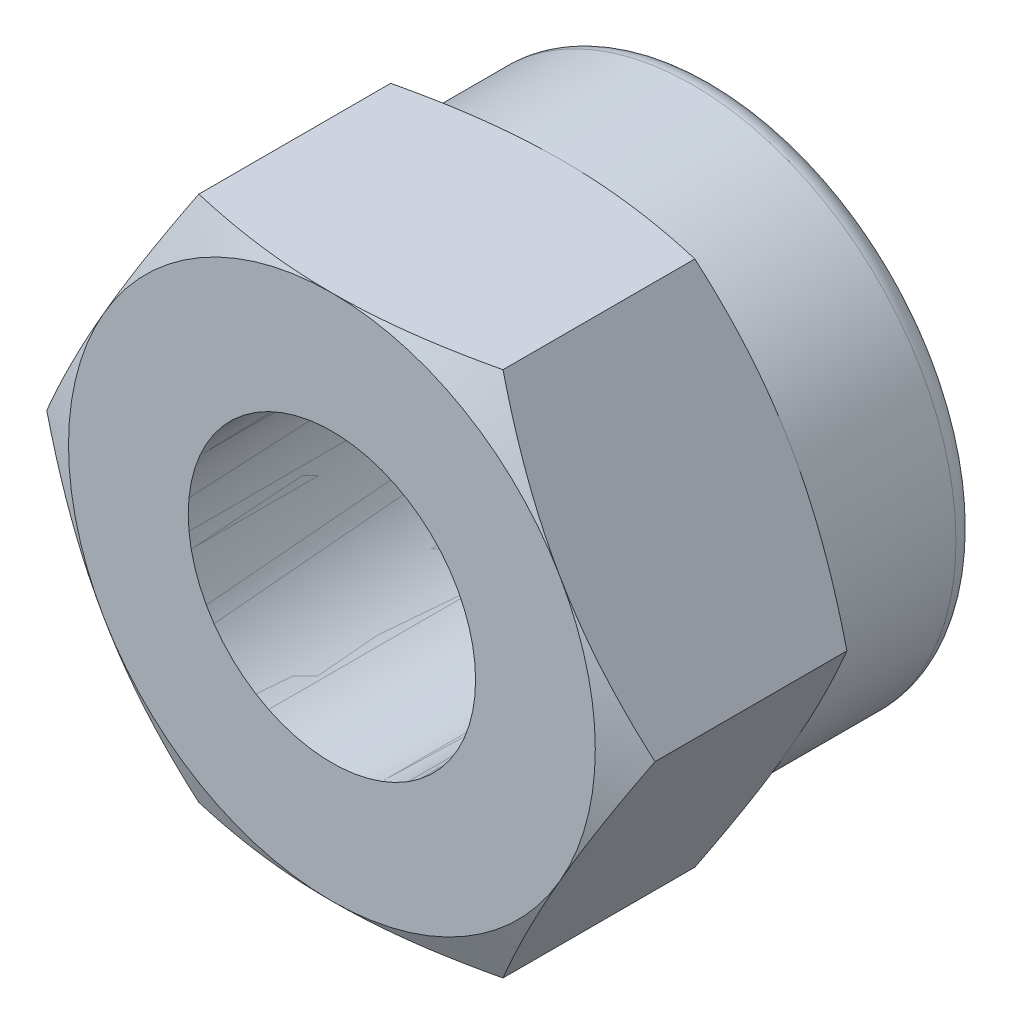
ISO-10303-21;
HEADER;
FILE_DESCRIPTION(('STEP AP214'),'2;1');
FILE_NAME('part.step','',(''),(''),'','','');
FILE_SCHEMA(('AUTOMOTIVE_DESIGN { 1 0 10303 214 1 1 1 1 }'));
ENDSEC;
DATA;
#1=APPLICATION_CONTEXT('core data for automotive mechanical design processes');
#2=APPLICATION_PROTOCOL_DEFINITION('international standard','automotive_design',2000,#1);
#3=PRODUCT_CONTEXT('',#1,'mechanical');
#4=PRODUCT('Part','Part','',(#3));
#5=PRODUCT_RELATED_PRODUCT_CATEGORY('part','',(#4));
#6=PRODUCT_DEFINITION_FORMATION('','',#4);
#7=PRODUCT_DEFINITION_CONTEXT('part definition',#1,'design');
#8=PRODUCT_DEFINITION('design','',#6,#7);
#9=PRODUCT_DEFINITION_SHAPE('','',#8);
#10=(LENGTH_UNIT() NAMED_UNIT(*) SI_UNIT(.MILLI.,.METRE.));
#11=(NAMED_UNIT(*) PLANE_ANGLE_UNIT() SI_UNIT($,.RADIAN.));
#12=(NAMED_UNIT(*) SI_UNIT($,.STERADIAN.) SOLID_ANGLE_UNIT());
#13=UNCERTAINTY_MEASURE_WITH_UNIT(LENGTH_MEASURE(1.E-05),#10,'distance_accuracy_value','');
#14=(GEOMETRIC_REPRESENTATION_CONTEXT(3) GLOBAL_UNCERTAINTY_ASSIGNED_CONTEXT((#13)) GLOBAL_UNIT_ASSIGNED_CONTEXT((#10,
#11,#12)) REPRESENTATION_CONTEXT('',''));
#15=CARTESIAN_POINT('',(0.,0.,0.));
#16=DIRECTION('',(0.,0.,1.));
#17=DIRECTION('',(1.,0.,0.));
#18=AXIS2_PLACEMENT_3D('',#15,#16,#17);
#19=CARTESIAN_POINT('',(0.,0.,2.4));
#20=DIRECTION('',(0.,0.,-1.));
#21=DIRECTION('',(-1.,0.,0.));
#22=AXIS2_PLACEMENT_3D('',#19,#20,#21);
#23=CYLINDRICAL_SURFACE('',#22,1.5);
#24=CARTESIAN_POINT('',(0.,0.,0.));
#25=DIRECTION('',(0.,0.,-1.));
#26=DIRECTION('',(-1.,0.,0.));
#27=AXIS2_PLACEMENT_3D('',#24,#25,#26);
#28=CIRCLE('',#27,1.5);
#29=CARTESIAN_POINT('',(-1.5,0.,0.));
#30=VERTEX_POINT('',#29);
#31=EDGE_CURVE('P0_E16',#30,#30,#28,.F.);
#32=ORIENTED_EDGE('',*,*,#31,.T.);
#33=EDGE_LOOP('',(#32));
#34=FACE_BOUND('',#33,.T.);
#35=CARTESIAN_POINT('',(0.,0.,2.4));
#36=DIRECTION('',(0.,0.,-1.));
#37=DIRECTION('',(-1.,0.,0.));
#38=AXIS2_PLACEMENT_3D('',#35,#36,#37);
#39=CIRCLE('',#38,1.5);
#40=CARTESIAN_POINT('',(-1.5,0.,2.4));
#41=VERTEX_POINT('',#40);
#42=EDGE_CURVE('P0_E10',#41,#41,#39,.T.);
#43=ORIENTED_EDGE('',*,*,#42,.T.);
#44=EDGE_LOOP('',(#43));
#45=FACE_BOUND('',#44,.T.);
#46=ADVANCED_FACE('P0_F15',(#34,#45),#23,.T.);
#47=OPEN_SHELL('',(#46));
#48=SHELL_BASED_SURFACE_MODEL('P0_B1',(#47));
#49=CARTESIAN_POINT('',(0.,0.,0.199569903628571));
#50=DIRECTION('',(0.,0.,1.));
#51=DIRECTION('',(0.,-1.,0.));
#52=AXIS2_PLACEMENT_3D('',#49,#50,#51);
#53=CONICAL_SURFACE('',#52,3.17797903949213,1.13446401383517);
#54=CARTESIAN_POINT('',(1.58771327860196,-2.75,0.198379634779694));
#55=CARTESIAN_POINT('',(1.45743313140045,-2.75,0.167999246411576));
#56=CARTESIAN_POINT('',(1.32647304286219,-2.75,0.140270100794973));
#57=CARTESIAN_POINT('',(1.06378563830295,-2.75,0.0914586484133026));
#58=CARTESIAN_POINT('',(0.932062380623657,-2.75,0.0703543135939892));
#59=CARTESIAN_POINT('',(0.667468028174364,-2.75,0.0359033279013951));
#60=CARTESIAN_POINT('',(0.534596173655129,-2.75,0.0225622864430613));
#61=CARTESIAN_POINT('',(0.334638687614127,-2.75,0.00909051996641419));
#62=CARTESIAN_POINT('',(0.267762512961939,-2.75,0.00568971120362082));
#63=CARTESIAN_POINT('',(0.133926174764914,-2.75,0.00114123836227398));
#64=CARTESIAN_POINT('',(0.0669660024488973,-2.75,-6.16666171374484E-06));
#65=CARTESIAN_POINT('',(0.,-2.75,3.81688682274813E-12));
#66=B_SPLINE_CURVE_WITH_KNOTS('',3,(#54,#55,#56,#57,#58,#59,#60,#61,#62,#63,#64,#65),
.UNSPECIFIED.,.F.,.F.,(4,2,2,2,2,4),(0.,0.401386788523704,0.801424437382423,1.20175077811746,
1.40260491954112,1.6034821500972),.UNSPECIFIED.);
#67=CARTESIAN_POINT('',(1.58771325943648,-2.75,0.198379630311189));
#68=VERTEX_POINT('',#67);
#69=CARTESIAN_POINT('',(0.,-2.75,1.90844438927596E-12));
#70=VERTEX_POINT('',#69);
#71=EDGE_CURVE('P1_E138',#68,#70,#66,.T.);
#72=ORIENTED_EDGE('',*,*,#71,.T.);
#73=CARTESIAN_POINT('',(0.,0.,0.));
#74=DIRECTION('',(0.,0.,1.));
#75=DIRECTION('',(1.,0.,0.));
#76=AXIS2_PLACEMENT_3D('',#73,#74,#75);
#77=CIRCLE('',#76,2.75);
#78=CARTESIAN_POINT('',(2.38156985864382,-1.3750000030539,1.82053797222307E-12));
#79=VERTEX_POINT('',#78);
#80=EDGE_CURVE('P1_E116',#79,#70,#77,.F.);
#81=ORIENTED_EDGE('',*,*,#80,.F.);
#82=CARTESIAN_POINT('',(2.38156985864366,-1.3750000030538,3.64105743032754E-12));
#83=CARTESIAN_POINT('',(2.34808686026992,-1.43299425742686,-6.16661975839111E-06));
#84=CARTESIAN_POINT('',(2.3146067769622,-1.49098346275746,0.0011412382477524));
#85=CARTESIAN_POINT('',(2.2476886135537,-1.60688912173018,0.00568971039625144));
#86=CARTESIAN_POINT('',(2.21425052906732,-1.66480558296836,0.00909051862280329));
#87=CARTESIAN_POINT('',(2.1142717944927,-1.83797383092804,0.022562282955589));
#88=CARTESIAN_POINT('',(2.04783587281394,-1.95304422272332,0.0359033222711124));
#89=CARTESIAN_POINT('',(1.91553870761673,-2.18218963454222,0.0703543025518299));
#90=CARTESIAN_POINT('',(1.84967708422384,-2.29626531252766,0.0914586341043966));
#91=CARTESIAN_POINT('',(1.71833339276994,-2.52375925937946,0.140270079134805));
#92=CARTESIAN_POINT('',(1.65285335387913,-2.63717401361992,0.167999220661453));
#93=CARTESIAN_POINT('',(1.58771328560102,-2.74999992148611,0.19837960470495));
#94=B_SPLINE_CURVE_WITH_KNOTS('',3,(#82,#83,#84,#85,#86,#87,#88,#89,#90,#91,#92,#93),
.UNSPECIFIED.,.F.,.F.,(4,2,2,2,2,4),(0.,0.200877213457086,0.40173133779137,0.802057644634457,
1.20209525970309,1.60348201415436),.UNSPECIFIED.);
#95=EDGE_CURVE('P1_E130',#79,#68,#94,.T.);
#96=ORIENTED_EDGE('',*,*,#95,.T.);
#97=EDGE_LOOP('',(#72,#81,#96));
#98=FACE_BOUND('',#97,.T.);
#99=ADVANCED_FACE('P1_F17',(#98),#53,.T.);
#100=CARTESIAN_POINT('',(0.,0.,0.199569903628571));
#101=DIRECTION('',(0.,0.,1.));
#102=DIRECTION('',(0.,-1.,0.));
#103=AXIS2_PLACEMENT_3D('',#100,#101,#102);
#104=CONICAL_SURFACE('',#103,3.17797903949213,1.13446401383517);
#105=CARTESIAN_POINT('',(-1.58771322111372,-2.75000003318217,0.19837963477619));
#106=CARTESIAN_POINT('',(-1.65285329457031,-2.6371741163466,0.167999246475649));
#107=CARTESIAN_POINT('',(-1.71833333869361,-2.52375935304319,0.140270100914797));
#108=CARTESIAN_POINT('',(-1.84967704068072,-2.29626538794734,0.0914586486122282));
#109=CARTESIAN_POINT('',(-1.91553866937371,-2.18218970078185,0.0703543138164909));
#110=CARTESIAN_POINT('',(-2.04783584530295,-1.95304427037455,0.0359033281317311));
#111=CARTESIAN_POINT('',(-2.11427177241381,-1.83797386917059,0.0225622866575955));
#112=CARTESIAN_POINT('',(-2.21425051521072,-1.6648056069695,0.00909052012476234));
#113=CARTESIAN_POINT('',(-2.24768860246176,-1.60688914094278,0.00568971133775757));
#114=CARTESIAN_POINT('',(-2.31460677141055,-1.490983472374,0.00114123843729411));
#115=CARTESIAN_POINT('',(-2.34808685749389,-1.43299426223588,-6.16662160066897E-06));
#116=CARTESIAN_POINT('',(-2.381569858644,-1.375000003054,3.8260401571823E-12));
#117=B_SPLINE_CURVE_WITH_KNOTS('',3,(#105,#106,#107,#108,#109,#110,#111,#112,#113,#114,#115,
#116),.UNSPECIFIED.,.F.,.F.,(4,2,2,2,2,4),(0.,0.40138678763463,0.801424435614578,
1.20175077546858,1.40260491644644,1.6034821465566),.UNSPECIFIED.);
#118=CARTESIAN_POINT('',(-1.58771323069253,-2.75000001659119,0.198379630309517));
#119=VERTEX_POINT('',#118);
#120=CARTESIAN_POINT('',(-2.3815698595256,-1.37500000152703,1.91301516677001E-12));
#121=VERTEX_POINT('',#120);
#122=EDGE_CURVE('P1_E150',#119,#121,#117,.T.);
#123=ORIENTED_EDGE('',*,*,#122,.T.);
#124=CARTESIAN_POINT('',(0.,0.,0.));
#125=DIRECTION('',(0.,0.,1.));
#126=DIRECTION('',(1.,0.,0.));
#127=AXIS2_PLACEMENT_3D('',#124,#125,#126);
#128=CIRCLE('',#127,2.75);
#129=EDGE_CURVE('P1_E149',#70,#121,#128,.F.);
#130=ORIENTED_EDGE('',*,*,#129,.F.);
#131=CARTESIAN_POINT('',(0.,-2.75,3.81691868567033E-12));
#132=CARTESIAN_POINT('',(-0.0669659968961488,-2.75,-6.16665968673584E-06));
#133=CARTESIAN_POINT('',(-0.133926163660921,-2.75,0.00114123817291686));
#134=CARTESIAN_POINT('',(-0.267762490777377,-2.75,0.005689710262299));
#135=CARTESIAN_POINT('',(-0.334638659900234,-2.75,0.00909051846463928));
#136=CARTESIAN_POINT('',(-0.53459612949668,-2.75,0.022562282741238));
#137=CARTESIAN_POINT('',(-0.667467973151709,-2.75,0.0359033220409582));
#138=CARTESIAN_POINT('',(-0.932062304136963,-2.75,0.0703543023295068));
#139=CARTESIAN_POINT('',(-1.06378555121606,-2.75,0.0914586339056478));
#140=CARTESIAN_POINT('',(-1.32647293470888,-2.75,0.140270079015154));
#141=CARTESIAN_POINT('',(-1.45743301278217,-2.75,0.167999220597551));
#142=CARTESIAN_POINT('',(-1.58771314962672,-2.75,0.198379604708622));
#143=B_SPLINE_CURVE_WITH_KNOTS('',3,(#131,#132,#133,#134,#135,#136,#137,#138,#139,#140,#141,
#142),.UNSPECIFIED.,.F.,.F.,(4,2,2,2,2,4),(0.,0.200877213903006,0.401731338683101,
0.802057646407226,1.20209526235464,1.60348201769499),.UNSPECIFIED.);
#144=EDGE_CURVE('P1_E155',#70,#119,#143,.T.);
#145=ORIENTED_EDGE('',*,*,#144,.T.);
#146=EDGE_LOOP('',(#123,#130,#145));
#147=FACE_BOUND('',#146,.T.);
#148=ADVANCED_FACE('P1_F229',(#147),#104,.T.);
#149=CARTESIAN_POINT('',(0.,0.,-1.365296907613));
#150=DIRECTION('',(0.,0.,1.));
#151=DIRECTION('',(-1.,0.,0.));
#152=AXIS2_PLACEMENT_3D('',#149,#150,#151);
#153=TOROIDAL_SURFACE('',#152,2.515296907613,0.2347030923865);
#154=CARTESIAN_POINT('',(0.,0.,-1.365296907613));
#155=DIRECTION('',(0.,0.,1.));
#156=DIRECTION('',(1.,0.,0.));
#157=AXIS2_PLACEMENT_3D('',#154,#155,#156);
#158=CIRCLE('',#157,2.75);
#159=CARTESIAN_POINT('',(2.75,0.,-1.365296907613));
#160=VERTEX_POINT('',#159);
#161=EDGE_CURVE('P1_E257',#160,#160,#158,.T.);
#162=ORIENTED_EDGE('',*,*,#161,.F.);
#163=EDGE_LOOP('',(#162));
#164=FACE_BOUND('',#163,.T.);
#165=CARTESIAN_POINT('',(0.,0.,-1.5999999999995));
#166=DIRECTION('',(0.,0.,1.));
#167=DIRECTION('',(1.,0.,0.));
#168=AXIS2_PLACEMENT_3D('',#165,#166,#167);
#169=CIRCLE('',#168,2.515296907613);
#170=CARTESIAN_POINT('',(2.515296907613,0.,-1.5999999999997));
#171=VERTEX_POINT('',#170);
#172=CARTESIAN_POINT('',(-2.515296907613,0.,-1.5999999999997));
#173=VERTEX_POINT('',#172);
#174=EDGE_CURVE('P1_E253',#171,#173,#169,.T.);
#175=ORIENTED_EDGE('',*,*,#174,.T.);
#176=CARTESIAN_POINT('',(0.,0.,-1.5999999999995));
#177=DIRECTION('',(0.,0.,1.));
#178=DIRECTION('',(-1.,0.,0.));
#179=AXIS2_PLACEMENT_3D('',#176,#177,#178);
#180=CIRCLE('',#179,2.515296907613);
#181=EDGE_CURVE('P1_E268',#173,#171,#180,.T.);
#182=ORIENTED_EDGE('',*,*,#181,.T.);
#183=EDGE_LOOP('',(#175,#182));
#184=FACE_BOUND('',#183,.T.);
#185=ADVANCED_FACE('P1_F232',(#164,#184),#153,.T.);
#186=CARTESIAN_POINT('',(0.,0.,0.199569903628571));
#187=DIRECTION('',(0.,0.,1.));
#188=DIRECTION('',(0.,-1.,0.));
#189=AXIS2_PLACEMENT_3D('',#186,#187,#188);
#190=CONICAL_SURFACE('',#189,3.17797903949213,1.13446401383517);
#191=CARTESIAN_POINT('',(-1.58771327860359,2.75,0.198379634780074));
#192=CARTESIAN_POINT('',(-1.45743313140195,2.75,0.167999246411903));
#193=CARTESIAN_POINT('',(-1.32647304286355,2.75,0.140270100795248));
#194=CARTESIAN_POINT('',(-1.06378563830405,2.75,0.0914586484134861));
#195=CARTESIAN_POINT('',(-0.932062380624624,2.75,0.0703543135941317));
#196=CARTESIAN_POINT('',(-0.66746802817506,2.75,0.0359033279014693));
#197=CARTESIAN_POINT('',(-0.534596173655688,2.75,0.0225622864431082));
#198=CARTESIAN_POINT('',(-0.334638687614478,2.75,0.00909051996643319));
#199=CARTESIAN_POINT('',(-0.26776251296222,2.75,0.0056897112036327));
#200=CARTESIAN_POINT('',(-0.133926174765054,2.75,0.0011412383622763));
#201=CARTESIAN_POINT('',(-0.0669660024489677,2.75,-6.16666171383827E-06));
#202=CARTESIAN_POINT('',(0.,2.75,3.81688584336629E-12));
#203=B_SPLINE_CURVE_WITH_KNOTS('',3,(#191,#192,#193,#194,#195,#196,#197,#198,#199,#200,#201,
#202),.UNSPECIFIED.,.F.,.F.,(4,2,2,2,2,4),(0.,0.401386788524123,0.801424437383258,
1.20175077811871,1.40260491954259,1.60348215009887),.UNSPECIFIED.);
#204=CARTESIAN_POINT('',(-1.58771325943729,2.75,0.198379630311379));
#205=VERTEX_POINT('',#204);
#206=CARTESIAN_POINT('',(0.,2.75,1.90844292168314E-12));
#207=VERTEX_POINT('',#206);
#208=EDGE_CURVE('P1_E269',#205,#207,#203,.T.);
#209=ORIENTED_EDGE('',*,*,#208,.T.);
#210=CARTESIAN_POINT('',(0.,0.,0.));
#211=DIRECTION('',(0.,0.,1.));
#212=DIRECTION('',(1.,0.,0.));
#213=AXIS2_PLACEMENT_3D('',#210,#211,#212);
#214=CIRCLE('',#213,2.75);
#215=CARTESIAN_POINT('',(-2.38156985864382,1.3750000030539,1.82054506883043E-12));
#216=VERTEX_POINT('',#215);
#217=EDGE_CURVE('P1_E124',#216,#207,#214,.F.);
#218=ORIENTED_EDGE('',*,*,#217,.F.);
#219=CARTESIAN_POINT('',(-2.38156985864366,1.3750000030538,3.64099115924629E-12));
#220=CARTESIAN_POINT('',(-2.34808686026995,1.4329942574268,-6.16661975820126E-06));
#221=CARTESIAN_POINT('',(-2.31460677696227,1.49098346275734,0.00114123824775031));
#222=CARTESIAN_POINT('',(-2.24768861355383,1.60688912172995,0.00568971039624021));
#223=CARTESIAN_POINT('',(-2.21425052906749,1.66480558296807,0.0090905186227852));
#224=CARTESIAN_POINT('',(-2.11427179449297,1.83797383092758,0.0225622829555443));
#225=CARTESIAN_POINT('',(-2.04783587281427,1.95304422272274,0.035903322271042));
#226=CARTESIAN_POINT('',(-1.91553870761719,2.18218963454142,0.0703543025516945));
#227=CARTESIAN_POINT('',(-1.84967708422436,2.29626531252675,0.091458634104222));
#228=CARTESIAN_POINT('',(-1.71833339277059,2.52375925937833,0.140270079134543));
#229=CARTESIAN_POINT('',(-1.65285335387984,2.63717401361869,0.167999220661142));
#230=CARTESIAN_POINT('',(-1.58771328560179,2.74999992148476,0.198379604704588));
#231=B_SPLINE_CURVE_WITH_KNOTS('',3,(#219,#220,#221,#222,#223,#224,#225,#226,#227,#228,#229,
#230),.UNSPECIFIED.,.F.,.F.,(4,2,2,2,2,4),(0.,0.200877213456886,0.401731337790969,
0.802057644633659,1.2020952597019,1.60348201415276),.UNSPECIFIED.);
#232=EDGE_CURVE('P1_E152',#216,#205,#231,.T.);
#233=ORIENTED_EDGE('',*,*,#232,.T.);
#234=EDGE_LOOP('',(#209,#218,#233));
#235=FACE_BOUND('',#234,.T.);
#236=ADVANCED_FACE('P1_F238',(#235),#190,.T.);
#237=CARTESIAN_POINT('',(0.,0.,-1.6));
#238=DIRECTION('',(0.,0.,1.));
#239=DIRECTION('',(1.,0.,0.));
#240=AXIS2_PLACEMENT_3D('',#237,#238,#239);
#241=PLANE('',#240);
#242=CARTESIAN_POINT('',(0.,0.,-1.6));
#243=DIRECTION('',(0.,0.,1.));
#244=DIRECTION('',(1.,0.,0.));
#245=AXIS2_PLACEMENT_3D('',#242,#243,#244);
#246=CIRCLE('',#245,2.415296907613);
#247=CARTESIAN_POINT('',(2.415296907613,0.,-1.6));
#248=VERTEX_POINT('',#247);
#249=EDGE_CURVE('P1_E123',#248,#248,#246,.T.);
#250=ORIENTED_EDGE('',*,*,#249,.T.);
#251=EDGE_LOOP('',(#250));
#252=FACE_BOUND('',#251,.T.);
#253=ORIENTED_EDGE('',*,*,#181,.F.);
#254=ORIENTED_EDGE('',*,*,#174,.F.);
#255=EDGE_LOOP('',(#253,#254));
#256=FACE_BOUND('',#255,.T.);
#257=ADVANCED_FACE('P1_F440',(#252,#256),#241,.F.);
#258=CARTESIAN_POINT('',(0.,0.,-1.689918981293));
#259=DIRECTION('',(0.,0.,1.));
#260=DIRECTION('',(1.,0.,0.));
#261=AXIS2_PLACEMENT_3D('',#258,#259,#260);
#262=CYLINDRICAL_SURFACE('',#261,2.75);
#263=ORIENTED_EDGE('',*,*,#161,.T.);
#264=EDGE_LOOP('',(#263));
#265=FACE_BOUND('',#264,.T.);
#266=CARTESIAN_POINT('',(0.,0.,0.));
#267=DIRECTION('',(0.,0.,1.));
#268=DIRECTION('',(-1.,0.,0.));
#269=AXIS2_PLACEMENT_3D('',#266,#267,#268);
#270=CIRCLE('',#269,2.74999999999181);
#271=CARTESIAN_POINT('',(2.3815698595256,1.37500000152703,1.91301195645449E-12));
#272=VERTEX_POINT('',#271);
#273=EDGE_CURVE('P1_E119',#272,#207,#270,.T.);
#274=ORIENTED_EDGE('',*,*,#273,.F.);
#275=CARTESIAN_POINT('',(0.,0.,0.));
#276=DIRECTION('',(0.,0.,1.));
#277=DIRECTION('',(1.,0.,0.));
#278=AXIS2_PLACEMENT_3D('',#275,#276,#277);
#279=CIRCLE('',#278,2.75);
#280=EDGE_CURVE('P1_E111',#272,#79,#279,.F.);
#281=ORIENTED_EDGE('',*,*,#280,.T.);
#282=ORIENTED_EDGE('',*,*,#80,.T.);
#283=ORIENTED_EDGE('',*,*,#129,.T.);
#284=CARTESIAN_POINT('',(0.,0.,0.));
#285=DIRECTION('',(0.,0.,1.));
#286=DIRECTION('',(1.,0.,0.));
#287=AXIS2_PLACEMENT_3D('',#284,#285,#286);
#288=CIRCLE('',#287,2.75);
#289=EDGE_CURVE('P1_E264',#121,#216,#288,.F.);
#290=ORIENTED_EDGE('',*,*,#289,.T.);
#291=ORIENTED_EDGE('',*,*,#217,.T.);
#292=EDGE_LOOP('',(#274,#281,#282,#283,#290,#291));
#293=FACE_BOUND('',#292,.T.);
#294=ADVANCED_FACE('P1_F113',(#265,#293),#262,.T.);
#295=CARTESIAN_POINT('',(0.,0.,-1.689918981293));
#296=DIRECTION('',(0.,0.,1.));
#297=DIRECTION('',(1.,0.,0.));
#298=AXIS2_PLACEMENT_3D('',#295,#296,#297);
#299=CYLINDRICAL_SURFACE('',#298,2.415296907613);
#300=ORIENTED_EDGE('',*,*,#249,.F.);
#301=EDGE_LOOP('',(#300));
#302=FACE_BOUND('',#301,.T.);
#303=CARTESIAN_POINT('',(0.,0.,-1.5));
#304=DIRECTION('',(0.,0.,1.));
#305=DIRECTION('',(1.,0.,0.));
#306=AXIS2_PLACEMENT_3D('',#303,#304,#305);
#307=CIRCLE('',#306,2.415296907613);
#308=CARTESIAN_POINT('',(2.415296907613,0.,-1.5));
#309=VERTEX_POINT('',#308);
#310=EDGE_CURVE('P1_E429',#309,#309,#307,.T.);
#311=ORIENTED_EDGE('',*,*,#310,.T.);
#312=EDGE_LOOP('',(#311));
#313=FACE_BOUND('',#312,.T.);
#314=ADVANCED_FACE('P1_F460',(#302,#313),#299,.F.);
#315=CARTESIAN_POINT('',(0.,0.,0.199569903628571));
#316=DIRECTION('',(0.,0.,1.));
#317=DIRECTION('',(0.,-1.,0.));
#318=AXIS2_PLACEMENT_3D('',#315,#316,#317);
#319=CONICAL_SURFACE('',#318,3.17797903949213,1.13446401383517);
#320=CARTESIAN_POINT('',(2.381569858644,1.375000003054,3.82605382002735E-12));
#321=CARTESIAN_POINT('',(2.34808685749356,1.43299426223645,-6.16662160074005E-06));
#322=CARTESIAN_POINT('',(2.31460677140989,1.49098347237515,0.00114123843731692));
#323=CARTESIAN_POINT('',(2.24768860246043,1.60688914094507,0.00568971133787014));
#324=CARTESIAN_POINT('',(2.21425051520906,1.66480560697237,0.00909052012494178));
#325=CARTESIAN_POINT('',(2.11427177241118,1.83797386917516,0.0225622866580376));
#326=CARTESIAN_POINT('',(2.04783584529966,1.95304427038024,0.0359033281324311));
#327=CARTESIAN_POINT('',(1.91553866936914,2.18218970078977,0.0703543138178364));
#328=CARTESIAN_POINT('',(1.84967704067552,2.29626538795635,0.0914586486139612));
#329=CARTESIAN_POINT('',(1.71833333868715,2.52375935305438,0.140270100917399));
#330=CARTESIAN_POINT('',(1.65285329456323,2.63717411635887,0.167999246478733));
#331=CARTESIAN_POINT('',(1.58771322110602,2.75000003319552,0.198379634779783));
#332=B_SPLINE_CURVE_WITH_KNOTS('',3,(#320,#321,#322,#323,#324,#325,#326,#327,#328,#329,#330,
#331),.UNSPECIFIED.,.F.,.F.,(4,2,2,2,2,4),(0.,0.200877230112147,0.401731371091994,
0.802057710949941,1.20209535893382,1.60348214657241),.UNSPECIFIED.);
#333=CARTESIAN_POINT('',(1.58771318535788,2.75000001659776,0.198379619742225));
#334=VERTEX_POINT('',#333);
#335=EDGE_CURVE('P1_E472',#272,#334,#332,.T.);
#336=ORIENTED_EDGE('',*,*,#335,.F.);
#337=ORIENTED_EDGE('',*,*,#273,.T.);
#338=CARTESIAN_POINT('',(0.,2.75,3.81693101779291E-12));
#339=CARTESIAN_POINT('',(0.0669659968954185,2.75,-6.16665968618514E-06));
#340=CARTESIAN_POINT('',(0.13392616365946,2.75,0.00114123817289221));
#341=CARTESIAN_POINT('',(0.267762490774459,2.75,0.0056897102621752));
#342=CARTESIAN_POINT('',(0.334638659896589,2.75,0.00909051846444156));
#343=CARTESIAN_POINT('',(0.534596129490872,2.75,0.0225622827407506));
#344=CARTESIAN_POINT('',(0.667467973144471,2.75,0.0359033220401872));
#345=CARTESIAN_POINT('',(0.932062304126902,2.75,0.0703543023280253));
#346=CARTESIAN_POINT('',(1.0637855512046,2.75,0.0914586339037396));
#347=CARTESIAN_POINT('',(1.32647293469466,2.75,0.140270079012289));
#348=CARTESIAN_POINT('',(1.45743301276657,2.75,0.167999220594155));
#349=CARTESIAN_POINT('',(1.58771314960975,2.75,0.198379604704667));
#350=B_SPLINE_CURVE_WITH_KNOTS('',3,(#338,#339,#340,#341,#342,#343,#344,#345,#346,#347,#348,
#349),.UNSPECIFIED.,.F.,.F.,(4,2,2,2,2,4),(0.,0.200877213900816,0.401731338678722,
0.802057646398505,1.20209526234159,1.60348201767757),.UNSPECIFIED.);
#351=EDGE_CURVE('P1_E291',#207,#334,#350,.T.);
#352=ORIENTED_EDGE('',*,*,#351,.T.);
#353=EDGE_LOOP('',(#336,#337,#352));
#354=FACE_BOUND('',#353,.T.);
#355=ADVANCED_FACE('P1_F462',(#354),#319,.T.);
#356=CARTESIAN_POINT('',(0.,0.,-1.5));
#357=DIRECTION('',(0.,0.,1.));
#358=DIRECTION('',(1.,0.,0.));
#359=AXIS2_PLACEMENT_3D('',#356,#357,#358);
#360=PLANE('',#359);
#361=CARTESIAN_POINT('',(0.,0.,-1.5));
#362=DIRECTION('',(0.,0.,1.));
#363=DIRECTION('',(1.,0.,0.));
#364=AXIS2_PLACEMENT_3D('',#361,#362,#363);
#365=CIRCLE('',#364,1.5);
#366=CARTESIAN_POINT('',(1.5,0.,-1.5));
#367=VERTEX_POINT('',#366);
#368=EDGE_CURVE('P1_E145',#367,#367,#365,.T.);
#369=ORIENTED_EDGE('',*,*,#368,.T.);
#370=EDGE_LOOP('',(#369));
#371=FACE_BOUND('',#370,.T.);
#372=ORIENTED_EDGE('',*,*,#310,.F.);
#373=EDGE_LOOP('',(#372));
#374=FACE_BOUND('',#373,.T.);
#375=ADVANCED_FACE('P1_F467',(#371,#374),#360,.F.);
#376=CARTESIAN_POINT('',(0.,0.,0.199569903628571));
#377=DIRECTION('',(0.,0.,1.));
#378=DIRECTION('',(0.,-1.,0.));
#379=AXIS2_PLACEMENT_3D('',#376,#377,#378);
#380=CONICAL_SURFACE('',#379,3.17797903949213,1.13446401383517);
#381=CARTESIAN_POINT('',(2.38156985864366,-1.3750000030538,3.64105743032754E-12));
#382=CARTESIAN_POINT('',(2.41505285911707,-1.317005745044,-6.16670139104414E-06));
#383=CARTESIAN_POINT('',(2.4485329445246,-1.25901653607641,0.00114123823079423));
#384=CARTESIAN_POINT('',(2.5154511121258,-1.14311086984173,0.00568971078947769));
#385=CARTESIAN_POINT('',(2.54888919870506,-1.08519440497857,0.00909051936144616));
#386=CARTESIAN_POINT('',(2.64886793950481,-0.912026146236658,0.0225622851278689));
#387=CARTESIAN_POINT('',(2.7153038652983,-0.796955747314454,0.0359033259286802));
#388=CARTESIAN_POINT('',(2.8476010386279,-0.56781032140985,0.0703543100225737));
#389=CARTESIAN_POINT('',(2.91346266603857,-0.453734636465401,0.0914586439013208));
#390=CARTESIAN_POINT('',(3.04480636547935,-0.22624067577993,0.140270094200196));
#391=CARTESIAN_POINT('',(3.11028640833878,-0.112825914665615,0.167999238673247));
#392=CARTESIAN_POINT('',(3.17542648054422,2.90638044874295E-12,0.19837962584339));
#393=B_SPLINE_CURVE_WITH_KNOTS('',3,(#381,#382,#383,#384,#385,#386,#387,#388,#389,#390,#391,
#392),.UNSPECIFIED.,.F.,.F.,(4,2,2,2,2,4),(0.,0.20087722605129,0.40173136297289,
0.802057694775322,1.20209533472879,1.60348211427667),.UNSPECIFIED.);
#394=CARTESIAN_POINT('',(3.17542648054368,-1.37442632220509E-12,0.198379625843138));
#395=VERTEX_POINT('',#394);
#396=EDGE_CURVE('P1_E133',#79,#395,#393,.T.);
#397=ORIENTED_EDGE('',*,*,#396,.F.);
#398=ORIENTED_EDGE('',*,*,#280,.F.);
#399=CARTESIAN_POINT('',(3.17542648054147,-4.20313392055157E-12,0.19837962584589));
#400=CARTESIAN_POINT('',(3.11028640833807,0.112825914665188,0.167999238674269));
#401=CARTESIAN_POINT('',(3.04480636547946,0.226240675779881,0.14027009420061));
#402=CARTESIAN_POINT('',(2.91346266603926,0.453734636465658,0.0914586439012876));
#403=CARTESIAN_POINT('',(2.84760103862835,0.567810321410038,0.0703543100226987));
#404=CARTESIAN_POINT('',(2.71530386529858,0.796955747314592,0.0359033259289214));
#405=CARTESIAN_POINT('',(2.64886793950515,0.912026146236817,0.0225622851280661));
#406=CARTESIAN_POINT('',(2.54888919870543,1.08519440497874,0.00909051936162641));
#407=CARTESIAN_POINT('',(2.51545111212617,1.1431108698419,0.00568971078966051));
#408=CARTESIAN_POINT('',(2.44853294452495,1.25901653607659,0.00114123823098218));
#409=CARTESIAN_POINT('',(2.41505285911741,1.31700574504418,-6.16670120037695E-06));
#410=CARTESIAN_POINT('',(2.381569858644,1.375000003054,3.82609427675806E-12));
#411=B_SPLINE_CURVE_WITH_KNOTS('',3,(#399,#400,#401,#402,#403,#404,#405,#406,#407,#408,#409,
#410),.UNSPECIFIED.,.F.,.F.,(4,2,2,2,2,4),(0.,0.401386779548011,0.801424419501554,
1.20175075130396,1.40260488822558,1.6034821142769),.UNSPECIFIED.);
#412=EDGE_CURVE('P1_E142',#395,#272,#411,.T.);
#413=ORIENTED_EDGE('',*,*,#412,.F.);
#414=EDGE_LOOP('',(#397,#398,#413));
#415=FACE_BOUND('',#414,.T.);
#416=ADVANCED_FACE('P1_F140',(#415),#380,.T.);
#417=CARTESIAN_POINT('',(3.175426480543,0.,0.));
#418=DIRECTION('',(0.866025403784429,0.500000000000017,0.));
#419=DIRECTION('',(-0.500000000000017,0.866025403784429,0.));
#420=AXIS2_PLACEMENT_3D('',#417,#418,#419);
#421=PLANE('',#420);
#422=DIRECTION('',(0.,0.,1.));
#423=VECTOR('',#422,1.);
#424=CARTESIAN_POINT('',(3.17542648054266,1.99059518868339E-13,0.));
#425=LINE('',#424,#423);
#426=CARTESIAN_POINT('',(3.1754264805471,1.99579023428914E-13,2.2016203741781));
#427=VERTEX_POINT('',#426);
#428=EDGE_CURVE('P1_E144',#395,#427,#425,.T.);
#429=ORIENTED_EDGE('',*,*,#428,.F.);
#430=ORIENTED_EDGE('',*,*,#412,.T.);
#431=ORIENTED_EDGE('',*,*,#335,.T.);
#432=DIRECTION('',(0.,0.,1.));
#433=VECTOR('',#432,1.);
#434=CARTESIAN_POINT('',(1.587713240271,2.75,0.));
#435=LINE('',#434,#433);
#436=CARTESIAN_POINT('',(1.58771324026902,2.75000000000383,2.20162037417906));
#437=VERTEX_POINT('',#436);
#438=EDGE_CURVE('P1_E424',#437,#334,#435,.F.);
#439=ORIENTED_EDGE('',*,*,#438,.F.);
#440=CARTESIAN_POINT('',(1.5877132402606,2.75000000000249,2.20162037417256));
#441=CARTESIAN_POINT('',(1.65285331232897,2.63717408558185,2.23200076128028));
#442=CARTESIAN_POINT('',(1.71833335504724,2.52375932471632,2.25972990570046));
#443=CARTESIAN_POINT('',(1.84967705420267,2.29626536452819,2.30854135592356));
#444=CARTESIAN_POINT('',(1.91553868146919,2.18218967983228,2.3296456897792));
#445=CARTESIAN_POINT('',(2.047835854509,1.95304425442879,2.36409667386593));
#446=CARTESIAN_POINT('',(2.11427178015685,1.83797385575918,2.37743771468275));
#447=CARTESIAN_POINT('',(2.21425052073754,1.6648055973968,2.39090948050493));
#448=CARTESIAN_POINT('',(2.24768860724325,1.60688913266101,2.39431028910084));
#449=CARTESIAN_POINT('',(2.31460677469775,1.49098346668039,2.39885876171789));
#450=CARTESIAN_POINT('',(2.34808686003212,1.4329942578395,2.4000061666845));
#451=CARTESIAN_POINT('',(2.38156986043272,1.37499999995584,2.400000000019));
#452=B_SPLINE_CURVE_WITH_KNOTS('',3,(#440,#441,#442,#443,#444,#445,#446,#447,#448,#449,#450,
#451),.UNSPECIFIED.,.F.,.F.,(4,2,2,2,2,4),(0.,0.401386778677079,0.801424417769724,
1.2017507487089,1.40260488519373,1.60348211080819),.UNSPECIFIED.);
#453=CARTESIAN_POINT('',(2.38156986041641,1.3749999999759,2.40000000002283));
#454=VERTEX_POINT('',#453);
#455=EDGE_CURVE('P1_E479',#437,#454,#452,.T.);
#456=ORIENTED_EDGE('',*,*,#455,.T.);
#457=CARTESIAN_POINT('',(2.38156986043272,1.37499999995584,2.400000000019));
#458=CARTESIAN_POINT('',(2.41505286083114,1.31700574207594,2.40000616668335));
#459=CARTESIAN_POINT('',(2.44853294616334,1.25901653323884,2.39885876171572));
#460=CARTESIAN_POINT('',(2.51545111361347,1.1431108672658,2.39431028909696));
#461=CARTESIAN_POINT('',(2.548889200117,1.08519440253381,2.39090948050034));
#462=CARTESIAN_POINT('',(2.64886794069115,0.91202614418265,2.37743771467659));
#463=CARTESIAN_POINT('',(2.71530386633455,0.796955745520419,2.36409667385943));
#464=CARTESIAN_POINT('',(2.84760103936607,0.567810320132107,2.32964568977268));
#465=CARTESIAN_POINT('',(2.91346266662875,0.453734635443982,2.30854135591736));
#466=CARTESIAN_POINT('',(3.04480636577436,0.226240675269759,2.25972990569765));
#467=CARTESIAN_POINT('',(3.11028640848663,0.112825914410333,2.23200076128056));
#468=CARTESIAN_POINT('',(3.17542648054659,-6.21506900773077E-12,2.20162037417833));
#469=B_SPLINE_CURVE_WITH_KNOTS('',3,(#457,#458,#459,#460,#461,#462,#463,#464,#465,#466,#467,
#468),.UNSPECIFIED.,.F.,.F.,(4,2,2,2,2,4),(0.,0.200877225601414,0.401731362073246,
0.802057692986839,1.20209533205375,1.60348211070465),.UNSPECIFIED.);
#470=EDGE_CURVE('P1_E498',#454,#427,#469,.T.);
#471=ORIENTED_EDGE('',*,*,#470,.T.);
#472=EDGE_LOOP('',(#429,#430,#431,#439,#456,#471));
#473=FACE_BOUND('',#472,.T.);
#474=ADVANCED_FACE('P1_F484',(#473),#421,.T.);
#475=CARTESIAN_POINT('',(0.,0.,-1.689918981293));
#476=DIRECTION('',(0.,0.,1.));
#477=DIRECTION('',(1.,0.,0.));
#478=AXIS2_PLACEMENT_3D('',#475,#476,#477);
#479=CYLINDRICAL_SURFACE('',#478,1.5);
#480=CARTESIAN_POINT('',(0.,0.,-0.75));
#481=DIRECTION('',(0.,0.,1.));
#482=DIRECTION('',(1.,0.,0.));
#483=AXIS2_PLACEMENT_3D('',#480,#481,#482);
#484=CIRCLE('',#483,1.5);
#485=CARTESIAN_POINT('',(1.5,0.,-0.75));
#486=VERTEX_POINT('',#485);
#487=EDGE_CURVE('P1_E370',#486,#486,#484,.F.);
#488=ORIENTED_EDGE('',*,*,#487,.F.);
#489=EDGE_LOOP('',(#488));
#490=FACE_BOUND('',#489,.T.);
#491=ORIENTED_EDGE('',*,*,#368,.F.);
#492=EDGE_LOOP('',(#491));
#493=FACE_BOUND('',#492,.T.);
#494=ADVANCED_FACE('P1_F487',(#490,#493),#479,.F.);
#495=CARTESIAN_POINT('',(1.587713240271,-2.75,0.));
#496=DIRECTION('',(0.866025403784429,-0.500000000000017,0.));
#497=DIRECTION('',(0.500000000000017,0.866025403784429,0.));
#498=AXIS2_PLACEMENT_3D('',#495,#496,#497);
#499=PLANE('',#498);
#500=DIRECTION('',(0.,0.,-1.));
#501=VECTOR('',#500,1.);
#502=CARTESIAN_POINT('',(1.587713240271,-2.75,0.));
#503=LINE('',#502,#501);
#504=CARTESIAN_POINT('',(1.58771324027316,-2.75000000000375,2.20162037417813));
#505=VERTEX_POINT('',#504);
#506=EDGE_CURVE('P1_E135',#68,#505,#503,.F.);
#507=ORIENTED_EDGE('',*,*,#506,.F.);
#508=ORIENTED_EDGE('',*,*,#95,.F.);
#509=ORIENTED_EDGE('',*,*,#396,.T.);
#510=ORIENTED_EDGE('',*,*,#428,.T.);
#511=CARTESIAN_POINT('',(3.17542648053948,1.06141289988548E-11,2.20162037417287));
#512=CARTESIAN_POINT('',(3.11028640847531,-0.112825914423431,2.23200076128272));
#513=CARTESIAN_POINT('',(3.04480636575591,-0.22624067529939,2.25972990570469));
#514=CARTESIAN_POINT('',(2.91346266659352,-0.453734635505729,2.30854135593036));
#515=CARTESIAN_POINT('',(2.84760103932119,-0.567810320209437,2.32964568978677));
#516=CARTESIAN_POINT('',(2.71530386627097,-0.79695574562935,2.36409667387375));
#517=CARTESIAN_POINT('',(2.6488679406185,-0.912026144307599,2.37743771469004));
#518=CARTESIAN_POINT('',(2.54888920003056,-1.08519440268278,2.39090948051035));
#519=CARTESIAN_POINT('',(2.51545111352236,-1.14311086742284,2.39431028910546));
#520=CARTESIAN_POINT('',(2.4485329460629,-1.25901653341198,2.39885876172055));
#521=CARTESIAN_POINT('',(2.41505286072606,-1.31700574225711,2.40000616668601));
#522=CARTESIAN_POINT('',(2.38156986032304,-1.37500000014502,2.40000000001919));
#523=B_SPLINE_CURVE_WITH_KNOTS('',3,(#511,#512,#513,#514,#515,#516,#517,#518,#519,#520,#521,
#522),.UNSPECIFIED.,.F.,.F.,(4,2,2,2,2,4),(0.,0.401386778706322,0.801424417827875,
1.20175074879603,1.40260488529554,1.60348211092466),.UNSPECIFIED.);
#524=CARTESIAN_POINT('',(2.38156986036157,-1.37500000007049,2.40000000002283));
#525=VERTEX_POINT('',#524);
#526=EDGE_CURVE('P1_E428',#427,#525,#523,.T.);
#527=ORIENTED_EDGE('',*,*,#526,.T.);
#528=CARTESIAN_POINT('',(2.38156986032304,-1.37500000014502,2.40000000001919));
#529=CARTESIAN_POINT('',(2.34808685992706,-1.4329942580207,2.40000616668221));
#530=CARTESIAN_POINT('',(2.31460677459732,-1.49098346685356,2.39885876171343));
#531=CARTESIAN_POINT('',(2.2476886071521,-1.60688913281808,2.3943102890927));
#532=CARTESIAN_POINT('',(2.21425052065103,-1.66480559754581,2.39090948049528));
#533=CARTESIAN_POINT('',(2.11427178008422,-1.83797385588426,2.37743771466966));
#534=CARTESIAN_POINT('',(2.04783585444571,-1.95304425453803,2.36409667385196));
#535=CARTESIAN_POINT('',(1.91553868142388,-2.18218967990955,2.32964568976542));
#536=CARTESIAN_POINT('',(1.84967705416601,-2.29626536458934,2.30854135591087));
#537=CARTESIAN_POINT('',(1.71833335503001,-2.52375932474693,2.25972990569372));
#538=CARTESIAN_POINT('',(1.65285331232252,-2.63717408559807,2.23200076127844));
#539=CARTESIAN_POINT('',(1.58771324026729,-2.75000000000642,2.20162037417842));
#540=B_SPLINE_CURVE_WITH_KNOTS('',3,(#528,#529,#530,#531,#532,#533,#534,#535,#536,#537,#538,
#539),.UNSPECIFIED.,.F.,.F.,(4,2,2,2,2,4),(0.,0.200877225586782,0.401731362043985,
0.802057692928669,1.20209533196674,1.60348211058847),.UNSPECIFIED.);
#541=EDGE_CURVE('P1_E312',#525,#505,#540,.T.);
#542=ORIENTED_EDGE('',*,*,#541,.T.);
#543=EDGE_LOOP('',(#507,#508,#509,#510,#527,#542));
#544=FACE_BOUND('',#543,.T.);
#545=ADVANCED_FACE('P1_F131',(#544),#499,.T.);
#546=CARTESIAN_POINT('',(1.587713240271,2.75,0.));
#547=DIRECTION('',(0.,1.,0.));
#548=DIRECTION('',(0.,0.,1.));
#549=AXIS2_PLACEMENT_3D('',#546,#547,#548);
#550=PLANE('',#549);
#551=ORIENTED_EDGE('',*,*,#438,.T.);
#552=ORIENTED_EDGE('',*,*,#351,.F.);
#553=ORIENTED_EDGE('',*,*,#208,.F.);
#554=DIRECTION('',(0.,0.,1.));
#555=VECTOR('',#554,1.);
#556=CARTESIAN_POINT('',(-1.587713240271,2.75,0.));
#557=LINE('',#556,#555);
#558=CARTESIAN_POINT('',(-1.58771324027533,2.75,2.20162037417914));
#559=VERTEX_POINT('',#558);
#560=EDGE_CURVE('P1_E334',#559,#205,#557,.F.);
#561=ORIENTED_EDGE('',*,*,#560,.F.);
#562=CARTESIAN_POINT('',(-1.58771324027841,2.74999999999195,2.20162037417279));
#563=CARTESIAN_POINT('',(-1.45743309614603,2.74999999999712,2.23200076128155));
#564=CARTESIAN_POINT('',(-1.32647301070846,2.74999999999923,2.2597299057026));
#565=CARTESIAN_POINT('',(-1.06378561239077,2.75000000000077,2.30854135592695));
#566=CARTESIAN_POINT('',(-0.932062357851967,2.7500000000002,2.32964568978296));
#567=CARTESIAN_POINT('',(-0.667468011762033,2.7499999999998,2.36409667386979));
#568=CARTESIAN_POINT('',(-0.534596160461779,2.74999999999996,2.37743771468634));
#569=CARTESIAN_POINT('',(-0.334638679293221,2.75000000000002,2.39090948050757));
#570=CARTESIAN_POINT('',(-0.267762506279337,2.75000000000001,2.39431028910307));
#571=CARTESIAN_POINT('',(-0.133926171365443,2.74999999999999,2.39885876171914));
#572=CARTESIAN_POINT('',(-0.0669660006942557,2.74999999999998,2.40000616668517));
#573=CARTESIAN_POINT('',(1.09340674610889E-10,2.75,2.40000000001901));
#574=B_SPLINE_CURVE_WITH_KNOTS('',3,(#562,#563,#564,#565,#566,#567,#568,#569,#570,#571,#572,
#573),.UNSPECIFIED.,.F.,.F.,(4,2,2,2,2,4),(0.,0.401386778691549,0.801424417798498,
1.20175074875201,1.40260488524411,1.60348211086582),.UNSPECIFIED.);
#575=CARTESIAN_POINT('',(5.46698788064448E-11,2.74999999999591,2.40000000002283));
#576=VERTEX_POINT('',#575);
#577=EDGE_CURVE('P1_E306',#559,#576,#574,.T.);
#578=ORIENTED_EDGE('',*,*,#577,.T.);
#579=CARTESIAN_POINT('',(1.09340741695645E-10,2.75,2.40000000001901));
#580=CARTESIAN_POINT('',(0.0669660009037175,2.75,2.4000061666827));
#581=CARTESIAN_POINT('',(0.133926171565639,2.75,2.39885876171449));
#582=CARTESIAN_POINT('',(0.267762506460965,2.75,2.39431028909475));
#583=CARTESIAN_POINT('',(0.334638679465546,2.75,2.39090948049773));
#584=CARTESIAN_POINT('',(0.534596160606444,2.75,2.37743771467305));
#585=CARTESIAN_POINT('',(0.667468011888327,2.75,2.36409667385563));
#586=CARTESIAN_POINT('',(0.932062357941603,2.75,2.329645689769));
#587=CARTESIAN_POINT('',(1.06378561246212,2.75,2.30854135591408));
#588=CARTESIAN_POINT('',(1.32647301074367,2.75,2.25972990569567));
#589=CARTESIAN_POINT('',(1.45743309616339,2.75,2.23200076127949));
#590=CARTESIAN_POINT('',(1.58771324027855,2.75,2.20162037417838));
#591=B_SPLINE_CURVE_WITH_KNOTS('',3,(#579,#580,#581,#582,#583,#584,#585,#586,#587,#588,#589,
#590),.UNSPECIFIED.,.F.,.F.,(4,2,2,2,2,4),(0.,0.200877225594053,0.401731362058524,
0.802057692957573,1.20209533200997,1.6034821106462),.UNSPECIFIED.);
#592=EDGE_CURVE('P1_E299',#576,#437,#591,.T.);
#593=ORIENTED_EDGE('',*,*,#592,.T.);
#594=EDGE_LOOP('',(#551,#552,#553,#561,#578,#593));
#595=FACE_BOUND('',#594,.T.);
#596=ADVANCED_FACE('P1_F280',(#595),#550,.T.);
#597=CARTESIAN_POINT('',(0.,0.,-0.75));
#598=DIRECTION('',(0.,0.,1.));
#599=DIRECTION('',(1.,0.,0.));
#600=AXIS2_PLACEMENT_3D('',#597,#598,#599);
#601=PLANE('',#600);
#602=ORIENTED_EDGE('',*,*,#487,.T.);
#603=EDGE_LOOP('',(#602));
#604=FACE_BOUND('',#603,.T.);
#605=CARTESIAN_POINT('',(0.,0.,-0.75));
#606=DIRECTION('',(0.,0.,1.));
#607=DIRECTION('',(1.,0.,0.));
#608=AXIS2_PLACEMENT_3D('',#605,#606,#607);
#609=CIRCLE('',#608,1.6);
#610=CARTESIAN_POINT('',(1.6,0.,-0.75));
#611=VERTEX_POINT('',#610);
#612=EDGE_CURVE('P1_E413',#611,#611,#609,.T.);
#613=ORIENTED_EDGE('',*,*,#612,.T.);
#614=EDGE_LOOP('',(#613));
#615=FACE_BOUND('',#614,.T.);
#616=ADVANCED_FACE('P1_F285',(#604,#615),#601,.T.);
#617=CARTESIAN_POINT('',(-1.587713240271,-2.75,0.));
#618=DIRECTION('',(0.,-1.,0.));
#619=DIRECTION('',(0.,0.,-1.));
#620=AXIS2_PLACEMENT_3D('',#617,#618,#619);
#621=PLANE('',#620);
#622=DIRECTION('',(0.,0.,1.));
#623=VECTOR('',#622,1.);
#624=CARTESIAN_POINT('',(-1.58771324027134,-2.7500000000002,0.));
#625=LINE('',#624,#623);
#626=CARTESIAN_POINT('',(-1.58771325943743,-2.7500000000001,2.20162036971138));
#627=VERTEX_POINT('',#626);
#628=EDGE_CURVE('P1_E409',#119,#627,#625,.T.);
#629=ORIENTED_EDGE('',*,*,#628,.F.);
#630=ORIENTED_EDGE('',*,*,#144,.F.);
#631=ORIENTED_EDGE('',*,*,#71,.F.);
#632=ORIENTED_EDGE('',*,*,#506,.T.);
#633=CARTESIAN_POINT('',(1.58771324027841,-2.74999999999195,2.20162037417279));
#634=CARTESIAN_POINT('',(1.45743309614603,-2.74999999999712,2.23200076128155));
#635=CARTESIAN_POINT('',(1.32647301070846,-2.74999999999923,2.2597299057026));
#636=CARTESIAN_POINT('',(1.06378561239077,-2.75000000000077,2.30854135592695));
#637=CARTESIAN_POINT('',(0.932062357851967,-2.7500000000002,2.32964568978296));
#638=CARTESIAN_POINT('',(0.667468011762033,-2.7499999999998,2.36409667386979));
#639=CARTESIAN_POINT('',(0.534596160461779,-2.74999999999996,2.37743771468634));
#640=CARTESIAN_POINT('',(0.334638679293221,-2.75000000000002,2.39090948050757));
#641=CARTESIAN_POINT('',(0.267762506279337,-2.75000000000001,2.39431028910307));
#642=CARTESIAN_POINT('',(0.133926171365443,-2.74999999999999,2.39885876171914));
#643=CARTESIAN_POINT('',(0.066966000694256,-2.74999999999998,2.40000616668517));
#644=CARTESIAN_POINT('',(-1.09340457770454E-10,-2.75,2.40000000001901));
#645=B_SPLINE_CURVE_WITH_KNOTS('',3,(#633,#634,#635,#636,#637,#638,#639,#640,#641,#642,#643,
#644),.UNSPECIFIED.,.F.,.F.,(4,2,2,2,2,4),(0.,0.401386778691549,0.801424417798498,
1.20175074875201,1.40260488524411,1.60348211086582),.UNSPECIFIED.);
#646=CARTESIAN_POINT('',(-5.46700157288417E-11,-2.74999999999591,2.40000000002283));
#647=VERTEX_POINT('',#646);
#648=EDGE_CURVE('P1_E365',#505,#647,#645,.T.);
#649=ORIENTED_EDGE('',*,*,#648,.T.);
#650=CARTESIAN_POINT('',(-1.0934057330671E-10,-2.75,2.40000000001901));
#651=CARTESIAN_POINT('',(-0.0669660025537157,-2.75,2.4000061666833));
#652=CARTESIAN_POINT('',(-0.133926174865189,-2.75,2.39885876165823));
#653=CARTESIAN_POINT('',(-0.267762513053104,-2.75,2.39431028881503));
#654=CARTESIAN_POINT('',(-0.334638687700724,-2.75,2.39090948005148));
#655=CARTESIAN_POINT('',(-0.534596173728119,-2.75,2.37743771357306));
#656=CARTESIAN_POINT('',(-0.667468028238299,-2.75,2.3640966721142));
#657=CARTESIAN_POINT('',(-0.93206238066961,-2.75,2.32964568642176));
#658=CARTESIAN_POINT('',(-1.06378563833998,-2.75,2.30854135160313));
#659=CARTESIAN_POINT('',(-1.3264730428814,-2.75,2.2597298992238));
#660=CARTESIAN_POINT('',(-1.45743313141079,-2.75,2.23200075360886));
#661=CARTESIAN_POINT('',(-1.58771327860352,-2.75,2.20162036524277));
#662=B_SPLINE_CURVE_WITH_KNOTS('',3,(#650,#651,#652,#653,#654,#655,#656,#657,#658,#659,#660,
#661),.UNSPECIFIED.,.F.,.F.,(4,2,2,2,2,4),(0.,0.200877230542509,0.401731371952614,
0.802057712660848,1.20209536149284,1.6034821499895),.UNSPECIFIED.);
#663=EDGE_CURVE('P1_E360',#647,#627,#662,.T.);
#664=ORIENTED_EDGE('',*,*,#663,.T.);
#665=EDGE_LOOP('',(#629,#630,#631,#632,#649,#664));
#666=FACE_BOUND('',#665,.T.);
#667=ADVANCED_FACE('P1_F348',(#666),#621,.T.);
#668=CARTESIAN_POINT('',(-1.587713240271,2.75,0.));
#669=DIRECTION('',(-0.866025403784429,0.500000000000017,0.));
#670=DIRECTION('',(-0.500000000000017,-0.866025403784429,0.));
#671=AXIS2_PLACEMENT_3D('',#668,#669,#670);
#672=PLANE('',#671);
#673=ORIENTED_EDGE('',*,*,#560,.T.);
#674=ORIENTED_EDGE('',*,*,#232,.F.);
#675=CARTESIAN_POINT('',(-3.17542648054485,-3.99700126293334E-12,0.198379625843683));
#676=CARTESIAN_POINT('',(-3.11028640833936,0.112825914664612,0.167999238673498));
#677=CARTESIAN_POINT('',(-3.04480636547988,0.226240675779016,0.140270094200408));
#678=CARTESIAN_POINT('',(-2.913462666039,0.453734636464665,0.0914586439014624));
#679=CARTESIAN_POINT('',(-2.84760103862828,0.567810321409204,0.0703543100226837));
#680=CARTESIAN_POINT('',(-2.71530386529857,0.796955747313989,0.0359033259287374));
#681=CARTESIAN_POINT('',(-2.64886793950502,0.912026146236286,0.0225622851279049));
#682=CARTESIAN_POINT('',(-2.54888919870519,1.08519440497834,0.00909051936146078));
#683=CARTESIAN_POINT('',(-2.51545111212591,1.14311086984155,0.00568971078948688));
#684=CARTESIAN_POINT('',(-2.44853294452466,1.25901653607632,0.00114123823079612));
#685=CARTESIAN_POINT('',(-2.4150528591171,1.31700574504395,-6.16670139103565E-06));
#686=CARTESIAN_POINT('',(-2.38156985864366,1.3750000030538,3.6409851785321E-12));
#687=B_SPLINE_CURVE_WITH_KNOTS('',3,(#675,#676,#677,#678,#679,#680,#681,#682,#683,#684,#685,
#686),.UNSPECIFIED.,.F.,.F.,(4,2,2,2,2,4),(0.,0.401386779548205,0.801424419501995,
1.20175075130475,1.40260488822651,1.60348211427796),.UNSPECIFIED.);
#688=CARTESIAN_POINT('',(-3.175426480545,-1.42709756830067E-13,0.198379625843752));
#689=VERTEX_POINT('',#688);
#690=EDGE_CURVE('P1_E336',#689,#216,#687,.T.);
#691=ORIENTED_EDGE('',*,*,#690,.F.);
#692=DIRECTION('',(0.,0.,1.));
#693=VECTOR('',#692,1.);
#694=CARTESIAN_POINT('',(-3.175426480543,0.,0.));
#695=LINE('',#694,#693);
#696=CARTESIAN_POINT('',(-3.17542648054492,-3.72559975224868E-12,2.20162037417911));
#697=VERTEX_POINT('',#696);
#698=EDGE_CURVE('P1_E407',#697,#689,#695,.F.);
#699=ORIENTED_EDGE('',*,*,#698,.F.);
#700=CARTESIAN_POINT('',(-3.17542648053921,-1.04118803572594E-11,2.20162037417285));
#701=CARTESIAN_POINT('',(-3.11028640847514,0.112825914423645,2.23200076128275));
#702=CARTESIAN_POINT('',(-3.04480636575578,0.226240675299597,2.25972990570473));
#703=CARTESIAN_POINT('',(-2.91346266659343,0.453734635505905,2.3085413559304));
#704=CARTESIAN_POINT('',(-2.84760103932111,0.567810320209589,2.3296456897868));
#705=CARTESIAN_POINT('',(-2.7153038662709,0.796955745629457,2.36409667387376));
#706=CARTESIAN_POINT('',(-2.64886794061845,0.912026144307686,2.37743771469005));
#707=CARTESIAN_POINT('',(-2.54888920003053,1.08519440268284,2.39090948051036));
#708=CARTESIAN_POINT('',(-2.51545111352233,1.14311086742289,2.39431028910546));
#709=CARTESIAN_POINT('',(-2.44853294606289,1.259016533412,2.39885876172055));
#710=CARTESIAN_POINT('',(-2.41505286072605,1.31700574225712,2.40000616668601));
#711=CARTESIAN_POINT('',(-2.38156986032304,1.37500000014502,2.40000000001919));
#712=B_SPLINE_CURVE_WITH_KNOTS('',3,(#700,#701,#702,#703,#704,#705,#706,#707,#708,#709,#710,
#711),.UNSPECIFIED.,.F.,.F.,(4,2,2,2,2,4),(0.,0.401386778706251,0.80142441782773,
1.20175074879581,1.40260488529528,1.60348211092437),.UNSPECIFIED.);
#713=CARTESIAN_POINT('',(-2.38156986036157,1.37500000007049,2.40000000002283));
#714=VERTEX_POINT('',#713);
#715=EDGE_CURVE('P1_E335',#697,#714,#712,.T.);
#716=ORIENTED_EDGE('',*,*,#715,.T.);
#717=CARTESIAN_POINT('',(-2.38156986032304,1.37500000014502,2.40000000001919));
#718=CARTESIAN_POINT('',(-2.34808685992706,1.4329942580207,2.40000616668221));
#719=CARTESIAN_POINT('',(-2.31460677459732,1.49098346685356,2.39885876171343));
#720=CARTESIAN_POINT('',(-2.2476886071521,1.60688913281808,2.3943102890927));
#721=CARTESIAN_POINT('',(-2.21425052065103,1.66480559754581,2.39090948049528));
#722=CARTESIAN_POINT('',(-2.11427178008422,1.83797385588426,2.37743771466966));
#723=CARTESIAN_POINT('',(-2.04783585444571,1.95304425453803,2.36409667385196));
#724=CARTESIAN_POINT('',(-1.91553868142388,2.18218967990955,2.32964568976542));
#725=CARTESIAN_POINT('',(-1.84967705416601,2.29626536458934,2.30854135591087));
#726=CARTESIAN_POINT('',(-1.71833335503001,2.52375932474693,2.25972990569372));
#727=CARTESIAN_POINT('',(-1.65285331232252,2.63717408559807,2.23200076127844));
#728=CARTESIAN_POINT('',(-1.58771324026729,2.75000000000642,2.20162037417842));
#729=B_SPLINE_CURVE_WITH_KNOTS('',3,(#717,#718,#719,#720,#721,#722,#723,#724,#725,#726,#727,
#728),.UNSPECIFIED.,.F.,.F.,(4,2,2,2,2,4),(0.,0.200877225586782,0.401731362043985,
0.802057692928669,1.20209533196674,1.60348211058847),.UNSPECIFIED.);
#730=EDGE_CURVE('P1_E327',#714,#559,#729,.T.);
#731=ORIENTED_EDGE('',*,*,#730,.T.);
#732=EDGE_LOOP('',(#673,#674,#691,#699,#716,#731));
#733=FACE_BOUND('',#732,.T.);
#734=ADVANCED_FACE('P1_F344',(#733),#672,.T.);
#735=CARTESIAN_POINT('',(0.,0.,0.199569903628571));
#736=DIRECTION('',(0.,0.,1.));
#737=DIRECTION('',(0.,-1.,0.));
#738=AXIS2_PLACEMENT_3D('',#735,#736,#737);
#739=CONICAL_SURFACE('',#738,3.17797903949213,1.13446401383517);
#740=ORIENTED_EDGE('',*,*,#690,.T.);
#741=ORIENTED_EDGE('',*,*,#289,.F.);
#742=CARTESIAN_POINT('',(-3.17542648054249,4.74273449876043E-12,0.198379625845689));
#743=CARTESIAN_POINT('',(-3.11028640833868,-0.112825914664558,0.167999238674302));
#744=CARTESIAN_POINT('',(-3.04480636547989,-0.226240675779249,0.140270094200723));
#745=CARTESIAN_POINT('',(-2.91346266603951,-0.453734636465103,0.0914586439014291));
#746=CARTESIAN_POINT('',(-2.84760103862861,-0.567810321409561,0.070354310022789));
#747=CARTESIAN_POINT('',(-2.71530386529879,-0.796955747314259,0.0359033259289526));
#748=CARTESIAN_POINT('',(-2.64886793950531,-0.912026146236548,0.0225622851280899));
#749=CARTESIAN_POINT('',(-2.54888919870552,-1.08519440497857,0.00909051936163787));
#750=CARTESIAN_POINT('',(-2.51545111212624,-1.14311086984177,0.00568971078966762));
#751=CARTESIAN_POINT('',(-2.44853294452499,-1.25901653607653,0.00114123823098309));
#752=CARTESIAN_POINT('',(-2.41505285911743,-1.31700574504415,-6.16670120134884E-06));
#753=CARTESIAN_POINT('',(-2.381569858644,-1.375000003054,3.82597051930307E-12));
#754=B_SPLINE_CURVE_WITH_KNOTS('',3,(#742,#743,#744,#745,#746,#747,#748,#749,#750,#751,#752,
#753),.UNSPECIFIED.,.F.,.F.,(4,2,2,2,2,4),(0.,0.401386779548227,0.801424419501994,
1.20175075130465,1.40260488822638,1.60348211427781),.UNSPECIFIED.);
#755=EDGE_CURVE('P1_E207',#689,#121,#754,.T.);
#756=ORIENTED_EDGE('',*,*,#755,.F.);
#757=EDGE_LOOP('',(#740,#741,#756));
#758=FACE_BOUND('',#757,.T.);
#759=ADVANCED_FACE('P1_F347',(#758),#739,.T.);
#760=CARTESIAN_POINT('',(0.,0.,-1.689918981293));
#761=DIRECTION('',(0.,0.,1.));
#762=DIRECTION('',(1.,0.,0.));
#763=AXIS2_PLACEMENT_3D('',#760,#761,#762);
#764=CYLINDRICAL_SURFACE('',#763,1.6);
#765=ORIENTED_EDGE('',*,*,#612,.F.);
#766=EDGE_LOOP('',(#765));
#767=FACE_BOUND('',#766,.T.);
#768=CARTESIAN_POINT('',(0.,0.,0.));
#769=DIRECTION('',(0.,0.,1.));
#770=DIRECTION('',(1.,0.,0.));
#771=AXIS2_PLACEMENT_3D('',#768,#769,#770);
#772=CIRCLE('',#771,1.6);
#773=CARTESIAN_POINT('',(1.6,0.,0.));
#774=VERTEX_POINT('',#773);
#775=EDGE_CURVE('P1_E415',#774,#774,#772,.T.);
#776=ORIENTED_EDGE('',*,*,#775,.T.);
#777=EDGE_LOOP('',(#776));
#778=FACE_BOUND('',#777,.T.);
#779=ADVANCED_FACE('P1_F202',(#767,#778),#764,.F.);
#780=CARTESIAN_POINT('',(-3.175426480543,0.,0.));
#781=DIRECTION('',(-0.866025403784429,-0.500000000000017,0.));
#782=DIRECTION('',(0.500000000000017,-0.866025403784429,0.));
#783=AXIS2_PLACEMENT_3D('',#780,#781,#782);
#784=PLANE('',#783);
#785=ORIENTED_EDGE('',*,*,#698,.T.);
#786=ORIENTED_EDGE('',*,*,#755,.T.);
#787=ORIENTED_EDGE('',*,*,#122,.F.);
#788=ORIENTED_EDGE('',*,*,#628,.T.);
#789=CARTESIAN_POINT('',(-2.38156986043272,-1.37499999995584,2.400000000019));
#790=CARTESIAN_POINT('',(-2.34808686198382,-1.4329942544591,2.40000616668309));
#791=CARTESIAN_POINT('',(-2.31460677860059,-1.49098345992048,2.398858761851));
#792=CARTESIAN_POINT('',(-2.24768861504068,-1.60688911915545,2.39431028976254));
#793=CARTESIAN_POINT('',(-2.21425053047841,-1.66480558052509,2.3909094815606));
#794=CARTESIAN_POINT('',(-2.11427179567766,-1.83797382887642,2.37743771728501));
#795=CARTESIAN_POINT('',(-2.04783587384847,-1.95304422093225,2.36409667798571));
#796=CARTESIAN_POINT('',(-1.91553870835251,-2.1821896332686,2.32964569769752));
#797=CARTESIAN_POINT('',(-1.8496770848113,-2.29626531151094,2.30854136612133));
#798=CARTESIAN_POINT('',(-1.71833339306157,-2.52375925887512,2.25972992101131));
#799=CARTESIAN_POINT('',(-1.65285335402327,-2.63717401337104,2.23200077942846));
#800=CARTESIAN_POINT('',(-1.58771328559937,-2.74999992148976,2.20162039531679));
#801=B_SPLINE_CURVE_WITH_KNOTS('',3,(#789,#790,#791,#792,#793,#794,#795,#796,#797,#798,#799,
#800),.UNSPECIFIED.,.F.,.F.,(4,2,2,2,2,4),(0.,0.200877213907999,0.401731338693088,
0.80205764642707,1.20209526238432,1.60348201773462),.UNSPECIFIED.);
#802=CARTESIAN_POINT('',(-2.38156986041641,-1.3749999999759,2.40000000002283));
#803=VERTEX_POINT('',#802);
#804=EDGE_CURVE('P1_E38',#803,#627,#801,.T.);
#805=ORIENTED_EDGE('',*,*,#804,.F.);
#806=CARTESIAN_POINT('',(-3.17542648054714,7.1651790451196E-12,2.20162037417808));
#807=CARTESIAN_POINT('',(-3.11028640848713,-0.112825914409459,2.23200076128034));
#808=CARTESIAN_POINT('',(-3.04480636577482,-0.226240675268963,2.25972990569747));
#809=CARTESIAN_POINT('',(-2.91346266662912,-0.453734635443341,2.30854135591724));
#810=CARTESIAN_POINT('',(-2.84760103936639,-0.567810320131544,2.32964568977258));
#811=CARTESIAN_POINT('',(-2.71530386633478,-0.796955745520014,2.36409667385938));
#812=CARTESIAN_POINT('',(-2.64886794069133,-0.912026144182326,2.37743771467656));
#813=CARTESIAN_POINT('',(-2.54888920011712,-1.0851944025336,2.39090948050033));
#814=CARTESIAN_POINT('',(-2.51545111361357,-1.14311086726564,2.39431028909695));
#815=CARTESIAN_POINT('',(-2.44853294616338,-1.25901653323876,2.39885876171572));
#816=CARTESIAN_POINT('',(-2.41505286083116,-1.3170057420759,2.40000616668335));
#817=CARTESIAN_POINT('',(-2.38156986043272,-1.37499999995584,2.400000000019));
#818=B_SPLINE_CURVE_WITH_KNOTS('',3,(#806,#807,#808,#809,#810,#811,#812,#813,#814,#815,#816,
#817),.UNSPECIFIED.,.F.,.F.,(4,2,2,2,2,4),(0.,0.401386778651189,0.801424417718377,
1.20175074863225,1.40260488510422,1.60348211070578),.UNSPECIFIED.);
#819=EDGE_CURVE('P1_E179',#697,#803,#818,.T.);
#820=ORIENTED_EDGE('',*,*,#819,.F.);
#821=EDGE_LOOP('',(#785,#786,#787,#788,#805,#820));
#822=FACE_BOUND('',#821,.T.);
#823=ADVANCED_FACE('P1_F196',(#822),#784,.T.);
#824=CARTESIAN_POINT('',(0.,0.,0.));
#825=DIRECTION('',(0.,0.,1.));
#826=DIRECTION('',(1.,0.,0.));
#827=AXIS2_PLACEMENT_3D('',#824,#825,#826);
#828=PLANE('',#827);
#829=CARTESIAN_POINT('',(0.,0.,0.));
#830=DIRECTION('',(0.,0.,1.));
#831=DIRECTION('',(1.,0.,0.));
#832=AXIS2_PLACEMENT_3D('',#829,#830,#831);
#833=CIRCLE('',#832,1.5);
#834=CARTESIAN_POINT('',(1.5,0.,0.));
#835=VERTEX_POINT('',#834);
#836=EDGE_CURVE('P1_E176',#835,#835,#833,.T.);
#837=ORIENTED_EDGE('',*,*,#836,.T.);
#838=EDGE_LOOP('',(#837));
#839=FACE_BOUND('',#838,.T.);
#840=ORIENTED_EDGE('',*,*,#775,.F.);
#841=EDGE_LOOP('',(#840));
#842=FACE_BOUND('',#841,.T.);
#843=ADVANCED_FACE('P1_F201',(#839,#842),#828,.F.);
#844=CARTESIAN_POINT('',(0.,0.,2.20043009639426));
#845=DIRECTION('',(0.,0.,-1.));
#846=DIRECTION('',(-1.,0.,0.));
#847=AXIS2_PLACEMENT_3D('',#844,#845,#846);
#848=CONICAL_SURFACE('',#847,3.17797903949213,1.13446401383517);
#849=ORIENTED_EDGE('',*,*,#804,.T.);
#850=ORIENTED_EDGE('',*,*,#663,.F.);
#851=CARTESIAN_POINT('',(0.,0.,2.40000000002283));
#852=DIRECTION('',(0.,0.,-1.));
#853=DIRECTION('',(-1.,0.,0.));
#854=AXIS2_PLACEMENT_3D('',#851,#852,#853);
#855=CIRCLE('',#854,2.74999999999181);
#856=EDGE_CURVE('P1_E173',#803,#647,#855,.F.);
#857=ORIENTED_EDGE('',*,*,#856,.F.);
#858=EDGE_LOOP('',(#849,#850,#857));
#859=FACE_BOUND('',#858,.T.);
#860=ADVANCED_FACE('P1_F375',(#859),#848,.T.);
#861=CARTESIAN_POINT('',(0.,0.,2.20043009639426));
#862=DIRECTION('',(0.,0.,-1.));
#863=DIRECTION('',(-1.,0.,0.));
#864=AXIS2_PLACEMENT_3D('',#861,#862,#863);
#865=CONICAL_SURFACE('',#864,3.17797903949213,1.13446401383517);
#866=ORIENTED_EDGE('',*,*,#648,.F.);
#867=ORIENTED_EDGE('',*,*,#541,.F.);
#868=CARTESIAN_POINT('',(0.,0.,2.40000000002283));
#869=DIRECTION('',(0.,0.,-1.));
#870=DIRECTION('',(-1.,0.,0.));
#871=AXIS2_PLACEMENT_3D('',#868,#869,#870);
#872=CIRCLE('',#871,2.74999999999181);
#873=EDGE_CURVE('P1_E170',#647,#525,#872,.F.);
#874=ORIENTED_EDGE('',*,*,#873,.F.);
#875=EDGE_LOOP('',(#866,#867,#874));
#876=FACE_BOUND('',#875,.T.);
#877=ADVANCED_FACE('P1_F371',(#876),#865,.T.);
#878=CARTESIAN_POINT('',(0.,0.,2.20043009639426));
#879=DIRECTION('',(0.,0.,-1.));
#880=DIRECTION('',(-1.,0.,0.));
#881=AXIS2_PLACEMENT_3D('',#878,#879,#880);
#882=CONICAL_SURFACE('',#881,3.17797903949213,1.13446401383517);
#883=ORIENTED_EDGE('',*,*,#470,.F.);
#884=CARTESIAN_POINT('',(0.,0.,2.40000000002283));
#885=DIRECTION('',(0.,0.,-1.));
#886=DIRECTION('',(-1.,0.,0.));
#887=AXIS2_PLACEMENT_3D('',#884,#885,#886);
#888=CIRCLE('',#887,2.74999999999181);
#889=EDGE_CURVE('P1_E167',#525,#454,#888,.F.);
#890=ORIENTED_EDGE('',*,*,#889,.F.);
#891=ORIENTED_EDGE('',*,*,#526,.F.);
#892=EDGE_LOOP('',(#883,#890,#891));
#893=FACE_BOUND('',#892,.T.);
#894=ADVANCED_FACE('P1_F374',(#893),#882,.T.);
#895=CARTESIAN_POINT('',(0.,0.,2.20043009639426));
#896=DIRECTION('',(0.,0.,-1.));
#897=DIRECTION('',(-1.,0.,0.));
#898=AXIS2_PLACEMENT_3D('',#895,#896,#897);
#899=CONICAL_SURFACE('',#898,3.17797903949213,1.13446401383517);
#900=ORIENTED_EDGE('',*,*,#455,.F.);
#901=ORIENTED_EDGE('',*,*,#592,.F.);
#902=CARTESIAN_POINT('',(0.,0.,2.40000000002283));
#903=DIRECTION('',(0.,0.,-1.));
#904=DIRECTION('',(-1.,0.,0.));
#905=AXIS2_PLACEMENT_3D('',#902,#903,#904);
#906=CIRCLE('',#905,2.74999999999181);
#907=EDGE_CURVE('P1_E164',#454,#576,#906,.F.);
#908=ORIENTED_EDGE('',*,*,#907,.F.);
#909=EDGE_LOOP('',(#900,#901,#908));
#910=FACE_BOUND('',#909,.T.);
#911=ADVANCED_FACE('P1_F321',(#910),#899,.T.);
#912=CARTESIAN_POINT('',(0.,0.,2.20043009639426));
#913=DIRECTION('',(0.,0.,-1.));
#914=DIRECTION('',(-1.,0.,0.));
#915=AXIS2_PLACEMENT_3D('',#912,#913,#914);
#916=CONICAL_SURFACE('',#915,3.17797903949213,1.13446401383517);
#917=ORIENTED_EDGE('',*,*,#577,.F.);
#918=ORIENTED_EDGE('',*,*,#730,.F.);
#919=CARTESIAN_POINT('',(0.,0.,2.40000000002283));
#920=DIRECTION('',(0.,0.,-1.));
#921=DIRECTION('',(-1.,0.,0.));
#922=AXIS2_PLACEMENT_3D('',#919,#920,#921);
#923=CIRCLE('',#922,2.74999999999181);
#924=EDGE_CURVE('P1_E161',#576,#714,#923,.F.);
#925=ORIENTED_EDGE('',*,*,#924,.F.);
#926=EDGE_LOOP('',(#917,#918,#925));
#927=FACE_BOUND('',#926,.T.);
#928=ADVANCED_FACE('P1_F318',(#927),#916,.T.);
#929=CARTESIAN_POINT('',(0.,0.,2.20043009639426));
#930=DIRECTION('',(0.,0.,-1.));
#931=DIRECTION('',(-1.,0.,0.));
#932=AXIS2_PLACEMENT_3D('',#929,#930,#931);
#933=CONICAL_SURFACE('',#932,3.17797903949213,1.13446401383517);
#934=ORIENTED_EDGE('',*,*,#715,.F.);
#935=ORIENTED_EDGE('',*,*,#819,.T.);
#936=CARTESIAN_POINT('',(0.,0.,2.40000000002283));
#937=DIRECTION('',(0.,0.,-1.));
#938=DIRECTION('',(-1.,0.,0.));
#939=AXIS2_PLACEMENT_3D('',#936,#937,#938);
#940=CIRCLE('',#939,2.74999999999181);
#941=EDGE_CURVE('P1_E29',#714,#803,#940,.F.);
#942=ORIENTED_EDGE('',*,*,#941,.F.);
#943=EDGE_LOOP('',(#934,#935,#942));
#944=FACE_BOUND('',#943,.T.);
#945=ADVANCED_FACE('P1_F192',(#944),#933,.T.);
#946=CARTESIAN_POINT('',(0.,0.,0.));
#947=DIRECTION('',(0.,0.,1.));
#948=DIRECTION('',(1.,0.,0.));
#949=AXIS2_PLACEMENT_3D('',#946,#947,#948);
#950=CYLINDRICAL_SURFACE('',#949,1.5);
#951=CARTESIAN_POINT('',(0.,0.,2.4));
#952=DIRECTION('',(0.,0.,1.));
#953=DIRECTION('',(1.,0.,0.));
#954=AXIS2_PLACEMENT_3D('',#951,#952,#953);
#955=CIRCLE('',#954,1.5);
#956=CARTESIAN_POINT('',(1.5,0.,2.4));
#957=VERTEX_POINT('',#956);
#958=EDGE_CURVE('P1_E11',#957,#957,#955,.F.);
#959=ORIENTED_EDGE('',*,*,#958,.F.);
#960=EDGE_LOOP('',(#959));
#961=FACE_BOUND('',#960,.T.);
#962=ORIENTED_EDGE('',*,*,#836,.F.);
#963=EDGE_LOOP('',(#962));
#964=FACE_BOUND('',#963,.T.);
#965=ADVANCED_FACE('P1_F390',(#961,#964),#950,.F.);
#966=CARTESIAN_POINT('',(0.,0.,2.4));
#967=DIRECTION('',(0.,0.,1.));
#968=DIRECTION('',(1.,0.,0.));
#969=AXIS2_PLACEMENT_3D('',#966,#967,#968);
#970=PLANE('',#969);
#971=ORIENTED_EDGE('',*,*,#958,.T.);
#972=EDGE_LOOP('',(#971));
#973=FACE_BOUND('',#972,.T.);
#974=ORIENTED_EDGE('',*,*,#924,.T.);
#975=ORIENTED_EDGE('',*,*,#941,.T.);
#976=ORIENTED_EDGE('',*,*,#856,.T.);
#977=ORIENTED_EDGE('',*,*,#873,.T.);
#978=ORIENTED_EDGE('',*,*,#889,.T.);
#979=ORIENTED_EDGE('',*,*,#907,.T.);
#980=EDGE_LOOP('',(#974,#975,#976,#977,#978,#979));
#981=FACE_BOUND('',#980,.T.);
#982=ADVANCED_FACE('P1_F388',(#973,#981),#970,.T.);
#983=CLOSED_SHELL('',(#99,#148,#185,#236,#257,#294,#314,#355,#375,#416,#474,#494,#545,#596,#616,
#667,#734,#759,#779,#823,#843,#860,#877,#894,#911,#928,#945,#965,#982));
#984=MANIFOLD_SOLID_BREP('P1_B1',#983);
#985=ADVANCED_BREP_SHAPE_REPRESENTATION('',(#18,#984),#14);
#986=MANIFOLD_SURFACE_SHAPE_REPRESENTATION('',(#18,#48),#14);
#987=SHAPE_REPRESENTATION('',(#18),#14);
#988=SHAPE_DEFINITION_REPRESENTATION(#9,#987);
#989=SHAPE_REPRESENTATION_RELATIONSHIP('','',#987,#985);
#990=SHAPE_REPRESENTATION_RELATIONSHIP('','',#987,#986);
ENDSEC;
END-ISO-10303-21;
